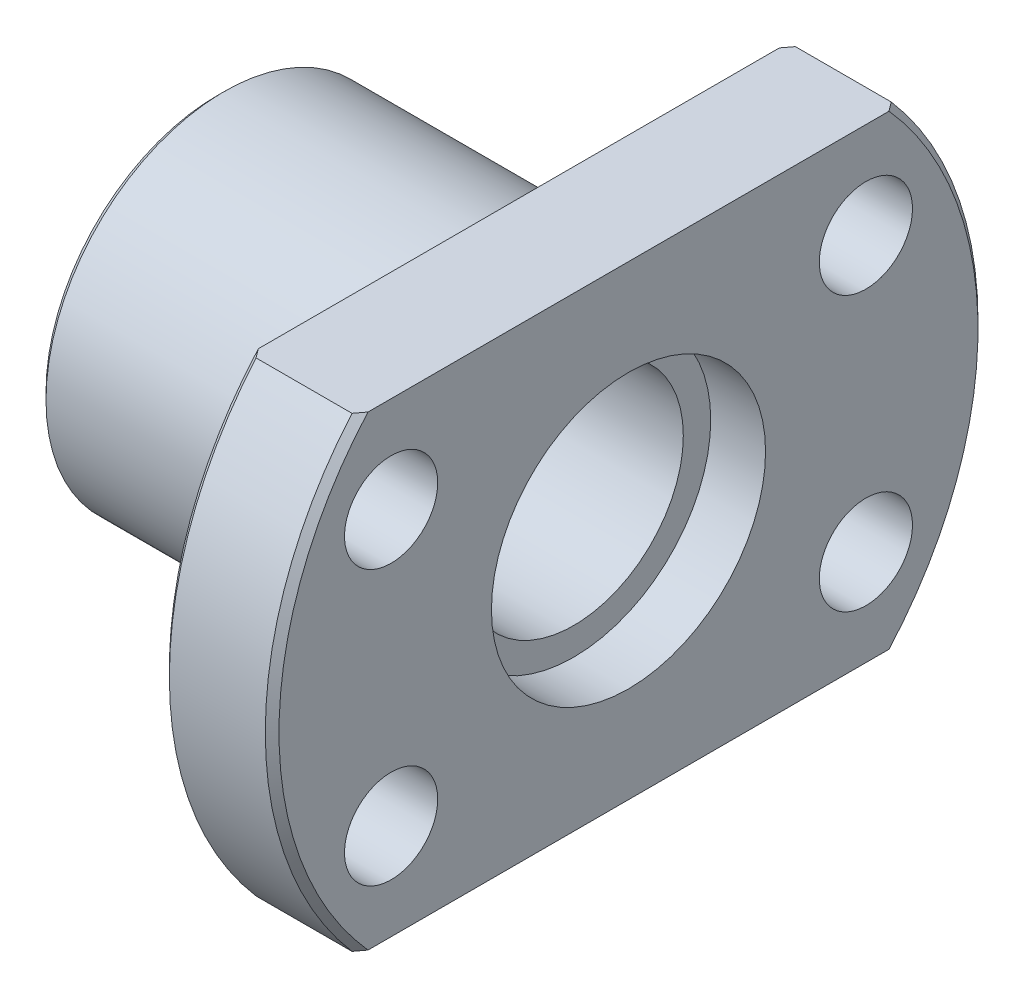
from build123d import *

# Parameters (mm, degrees)
SKETCH2_W          = 52
SKETCH2_H          = 34
SKETCH2_W_2        = 26.2
SKETCH2_H_2        = 17
CUT_EXTRUDE1_DEPTH = 4
SKETCH3_W          = 4
SKETCH3_H          = 1.7
SKETCH4_W          = 4
SKETCH4_H          = 1.7
SKETCH5_W          = 4
SKETCH5_H          = 1.7
SKETCH6_W          = 4
SKETCH6_H          = 1.7


with BuildPart() as part:
    # Sketch1 → Revolve1 (revolve)
    with BuildSketch(Plane.XY, mode=Mode.PRIVATE) as revolve1_sk:
        Polygon((0, 6.25), (0, 5), (2, 5), (2, 4), (13, 4), (13, 5), (15, 5), (15, 12.75), (14.75, 13), (11.25, 13), (11, 12.75), (11, 6), (10.5, 6), (10.5, 6.5), (0.25, 6.5), align=None)
    revolve(revolve1_sk.sketch.rotate(Axis((15, 0, 0), (-1, 0, 0)), 270), axis=Axis((15, 0, 0), (-1, 0, 0)))

    # Sketch2 → Cut-Extrude1 (cut)
    with BuildSketch(Plane(origin=(15, 0, 0), x_dir=(0, 0, -1), z_dir=(1, 0, 0))):
        Rectangle(SKETCH2_W, SKETCH2_H)
        Rectangle(SKETCH2_W_2, SKETCH2_H_2, mode=Mode.SUBTRACT)
    extrude(amount=-CUT_EXTRUDE1_DEPTH, mode=Mode.SUBTRACT)

    # Sketch3 → Cut-Revolve1 (revolve, cut)
    with BuildSketch(Plane(origin=(0, 0, 0), x_dir=(1, 0, 0), z_dir=(0, 0.8660254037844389, 0.49999999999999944)), mode=Mode.PRIVATE) as cut_revolve1_sk:
        with Locations((13, 10.85)):
            Rectangle(SKETCH3_W, SKETCH3_H)
    revolve(cut_revolve1_sk.sketch.rotate(Axis((15, 5, -8.660254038), (-1, 0, 0)), 30), axis=Axis((15, 5, -8.660254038), (-1, 0, 0)), mode=Mode.SUBTRACT)

    # Sketch4 → Cut-Revolve2 (revolve, cut)
    with BuildSketch(Plane(origin=(0, -7.5, -4.330127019), x_dir=(1, 0, 0), z_dir=(0, 0.8660254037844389, 0.49999999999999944)), mode=Mode.PRIVATE) as cut_revolve2_sk:
        with Locations((13, 5.85)):
            Rectangle(SKETCH4_W, SKETCH4_H)
    revolve(cut_revolve2_sk.sketch.rotate(Axis((15, -5, -8.660254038), (-1, 0, 0)), 30), axis=Axis((15, -5, -8.660254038), (-1, 0, 0)), mode=Mode.SUBTRACT)

    # Sketch5 → Cut-Revolve3 (revolve, cut)
    with BuildSketch(Plane(origin=(0, 0, 0), x_dir=(1, 0, 0), z_dir=(0, 0.8660254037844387, 0.4999999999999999)), mode=Mode.PRIVATE) as cut_revolve3_sk:
        with Locations((13, -9.15)):
            Rectangle(SKETCH5_W, SKETCH5_H)
    revolve(cut_revolve3_sk.sketch.rotate(Axis((15, -5, 8.660254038), (-1, 0, 0)), 30), axis=Axis((15, -5, 8.660254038), (-1, 0, 0)), mode=Mode.SUBTRACT)

    # Sketch6 → Cut-Revolve4 (revolve, cut)
    with BuildSketch(Plane(origin=(0, 7.5, 4.330127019), x_dir=(1, 0, 0), z_dir=(0, 0.8660254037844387, 0.4999999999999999)), mode=Mode.PRIVATE) as cut_revolve4_sk:
        with Locations((13, -4.15)):
            Rectangle(SKETCH6_W, SKETCH6_H)
    revolve(cut_revolve4_sk.sketch.rotate(Axis((15, 5, 8.660254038), (-1, 0, 0)), 30), axis=Axis((15, 5, 8.660254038), (-1, 0, 0)), mode=Mode.SUBTRACT)


solid = part.part
